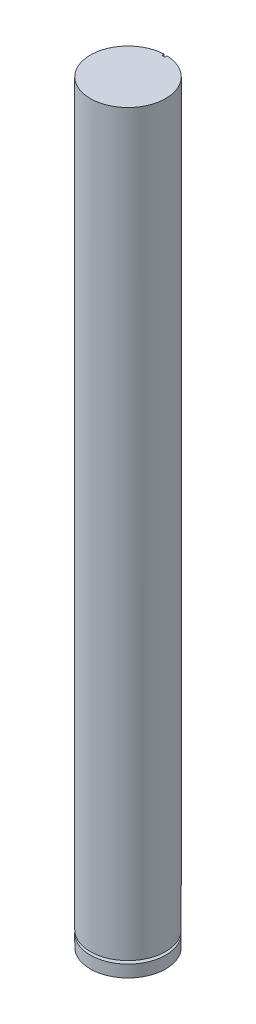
from build123d import *

# Parameters (mm, degrees)
SKETCH1_R           = 2.5
BOSS_EXTRUDE1_DEPTH = 50
SKETCH2_W           = 0.5
SKETCH2_H           = 0.2
SKETCH3_W           = 0.2
SKETCH3_H           = 0.15
CUT_EXTRUDE1_DEPTH  = 3


with BuildPart() as part:
    # Sketch1 → Boss-Extrude1 (new body)
    with BuildSketch(Plane(origin=(0, 0, 0), x_dir=(1, 0, 0), z_dir=(0, 1, 0))):
        with Locations(Location((0, 0, 0), (0, 0, 270))):
            Circle(SKETCH1_R)
    extrude(amount=BOSS_EXTRUDE1_DEPTH)

    # Sketch2 → Cut-Revolve1 (revolve, cut)
    with BuildSketch(Plane(origin=(0, 0, 0), x_dir=(0, 0, -1), z_dir=(1, 0, 0))):
        with Locations((2.25, 0.9)):
            Rectangle(SKETCH2_W, SKETCH2_H)
    revolve(axis=Axis((0, 0, 0), (0, 1, 0)), mode=Mode.SUBTRACT)

    # Sketch3 → Cut-Extrude1 (cut)
    with BuildSketch(Plane(origin=(0, 50, 0), x_dir=(1, 0, 0), z_dir=(0, 1, 0))):
        with Locations((0, 2.425)):
            Rectangle(SKETCH3_W, SKETCH3_H)
    extrude(amount=-CUT_EXTRUDE1_DEPTH, mode=Mode.SUBTRACT)


solid = part.part
